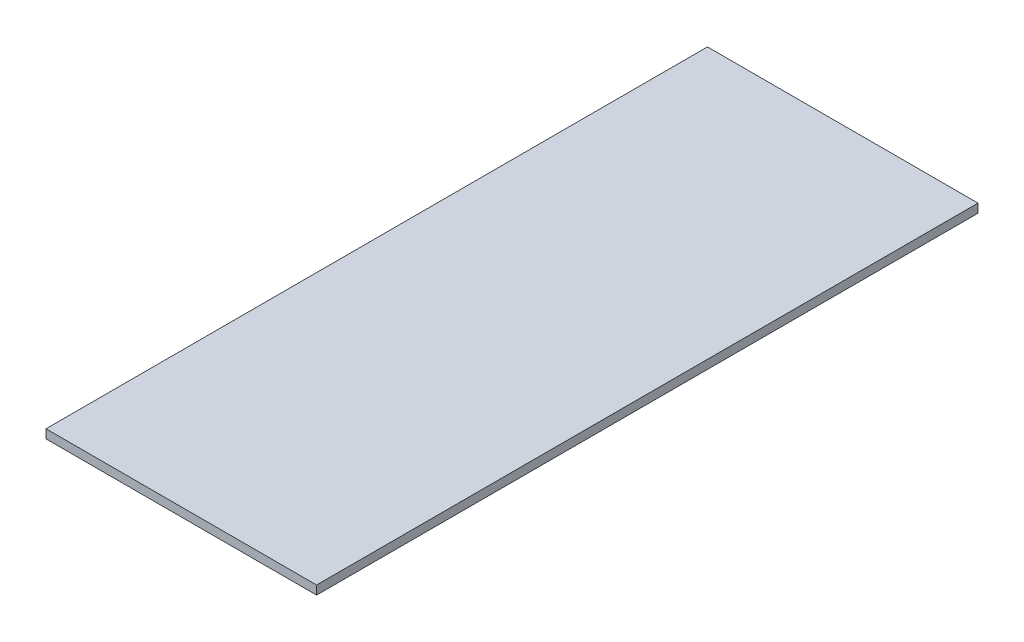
ISO-10303-21;
HEADER;
FILE_DESCRIPTION(('STEP AP214'),'2;1');
FILE_NAME('part.step','',(''),(''),'','','');
FILE_SCHEMA(('AUTOMOTIVE_DESIGN { 1 0 10303 214 1 1 1 1 }'));
ENDSEC;
DATA;
#1=APPLICATION_CONTEXT('core data for automotive mechanical design processes');
#2=APPLICATION_PROTOCOL_DEFINITION('international standard','automotive_design',2000,#1);
#3=PRODUCT_CONTEXT('',#1,'mechanical');
#4=PRODUCT('Part','Part','',(#3));
#5=PRODUCT_RELATED_PRODUCT_CATEGORY('part','',(#4));
#6=PRODUCT_DEFINITION_FORMATION('','',#4);
#7=PRODUCT_DEFINITION_CONTEXT('part definition',#1,'design');
#8=PRODUCT_DEFINITION('design','',#6,#7);
#9=PRODUCT_DEFINITION_SHAPE('','',#8);
#10=(LENGTH_UNIT() NAMED_UNIT(*) SI_UNIT(.MILLI.,.METRE.));
#11=(NAMED_UNIT(*) PLANE_ANGLE_UNIT() SI_UNIT($,.RADIAN.));
#12=(NAMED_UNIT(*) SI_UNIT($,.STERADIAN.) SOLID_ANGLE_UNIT());
#13=UNCERTAINTY_MEASURE_WITH_UNIT(LENGTH_MEASURE(1.E-05),#10,'distance_accuracy_value','');
#14=(GEOMETRIC_REPRESENTATION_CONTEXT(3) GLOBAL_UNCERTAINTY_ASSIGNED_CONTEXT((#13)) GLOBAL_UNIT_ASSIGNED_CONTEXT((#10,
#11,#12)) REPRESENTATION_CONTEXT('',''));
#15=CARTESIAN_POINT('',(0.,0.,0.));
#16=DIRECTION('',(0.,0.,1.));
#17=DIRECTION('',(1.,0.,0.));
#18=AXIS2_PLACEMENT_3D('',#15,#16,#17);
#19=CARTESIAN_POINT('',(85.725,5.55625,-209.55));
#20=DIRECTION('',(-1.,0.,0.));
#21=DIRECTION('',(0.,0.,1.));
#22=AXIS2_PLACEMENT_3D('',#19,#20,#21);
#23=PLANE('',#22);
#24=DIRECTION('',(0.,0.,-1.));
#25=VECTOR('',#24,1.);
#26=CARTESIAN_POINT('',(85.725,0.,-209.55));
#27=LINE('',#26,#25);
#28=CARTESIAN_POINT('',(85.725,0.,209.55));
#29=VERTEX_POINT('',#28);
#30=CARTESIAN_POINT('',(85.725,0.,-209.55));
#31=VERTEX_POINT('',#30);
#32=EDGE_CURVE('E105',#29,#31,#27,.T.);
#33=ORIENTED_EDGE('',*,*,#32,.T.);
#34=DIRECTION('',(0.,-1.,0.));
#35=VECTOR('',#34,1.);
#36=CARTESIAN_POINT('',(85.725,5.55625,-209.55));
#37=LINE('',#36,#35);
#38=CARTESIAN_POINT('',(85.725,5.55625,-209.55));
#39=VERTEX_POINT('',#38);
#40=EDGE_CURVE('E11',#39,#31,#37,.T.);
#41=ORIENTED_EDGE('',*,*,#40,.F.);
#42=DIRECTION('',(0.,0.,-1.));
#43=VECTOR('',#42,1.);
#44=CARTESIAN_POINT('',(85.725,5.55625,-209.55));
#45=LINE('',#44,#43);
#46=CARTESIAN_POINT('',(85.725,5.55625,209.55));
#47=VERTEX_POINT('',#46);
#48=EDGE_CURVE('E88',#47,#39,#45,.T.);
#49=ORIENTED_EDGE('',*,*,#48,.F.);
#50=DIRECTION('',(0.,-1.,0.));
#51=VECTOR('',#50,1.);
#52=CARTESIAN_POINT('',(85.725,5.55625,209.55));
#53=LINE('',#52,#51);
#54=EDGE_CURVE('E101',#47,#29,#53,.T.);
#55=ORIENTED_EDGE('',*,*,#54,.T.);
#56=EDGE_LOOP('',(#33,#41,#49,#55));
#57=FACE_BOUND('',#56,.T.);
#58=ADVANCED_FACE('F36',(#57),#23,.F.);
#59=CARTESIAN_POINT('',(-85.725,5.55625,-209.55));
#60=DIRECTION('',(0.,0.,1.));
#61=DIRECTION('',(1.,0.,0.));
#62=AXIS2_PLACEMENT_3D('',#59,#60,#61);
#63=PLANE('',#62);
#64=DIRECTION('',(-1.,0.,0.));
#65=VECTOR('',#64,1.);
#66=CARTESIAN_POINT('',(-85.725,0.,-209.55));
#67=LINE('',#66,#65);
#68=CARTESIAN_POINT('',(-85.725,0.,-209.55));
#69=VERTEX_POINT('',#68);
#70=EDGE_CURVE('E93',#31,#69,#67,.T.);
#71=ORIENTED_EDGE('',*,*,#70,.T.);
#72=DIRECTION('',(0.,-1.,0.));
#73=VECTOR('',#72,1.);
#74=CARTESIAN_POINT('',(-85.725,5.55625,-209.55));
#75=LINE('',#74,#73);
#76=CARTESIAN_POINT('',(-85.725,5.55625,-209.55));
#77=VERTEX_POINT('',#76);
#78=EDGE_CURVE('E45',#77,#69,#75,.T.);
#79=ORIENTED_EDGE('',*,*,#78,.F.);
#80=DIRECTION('',(-1.,0.,0.));
#81=VECTOR('',#80,1.);
#82=CARTESIAN_POINT('',(-85.725,5.55625,-209.55));
#83=LINE('',#82,#81);
#84=EDGE_CURVE('E83',#39,#77,#83,.T.);
#85=ORIENTED_EDGE('',*,*,#84,.F.);
#86=ORIENTED_EDGE('',*,*,#40,.T.);
#87=EDGE_LOOP('',(#71,#79,#85,#86));
#88=FACE_BOUND('',#87,.T.);
#89=ADVANCED_FACE('F92',(#88),#63,.F.);
#90=CARTESIAN_POINT('',(-85.725,5.55625,-209.55));
#91=DIRECTION('',(1.,0.,0.));
#92=DIRECTION('',(0.,0.,-1.));
#93=AXIS2_PLACEMENT_3D('',#90,#91,#92);
#94=PLANE('',#93);
#95=DIRECTION('',(0.,0.,1.));
#96=VECTOR('',#95,1.);
#97=CARTESIAN_POINT('',(-85.725,0.,-209.55));
#98=LINE('',#97,#96);
#99=CARTESIAN_POINT('',(-85.725,0.,209.55));
#100=VERTEX_POINT('',#99);
#101=EDGE_CURVE('E70',#69,#100,#98,.T.);
#102=ORIENTED_EDGE('',*,*,#101,.T.);
#103=DIRECTION('',(0.,-1.,0.));
#104=VECTOR('',#103,1.);
#105=CARTESIAN_POINT('',(-85.725,5.55625,209.55));
#106=LINE('',#105,#104);
#107=CARTESIAN_POINT('',(-85.725,5.55625,209.55));
#108=VERTEX_POINT('',#107);
#109=EDGE_CURVE('E95',#108,#100,#106,.T.);
#110=ORIENTED_EDGE('',*,*,#109,.F.);
#111=DIRECTION('',(0.,0.,1.));
#112=VECTOR('',#111,1.);
#113=CARTESIAN_POINT('',(-85.725,5.55625,-209.55));
#114=LINE('',#113,#112);
#115=EDGE_CURVE('E86',#77,#108,#114,.T.);
#116=ORIENTED_EDGE('',*,*,#115,.F.);
#117=ORIENTED_EDGE('',*,*,#78,.T.);
#118=EDGE_LOOP('',(#102,#110,#116,#117));
#119=FACE_BOUND('',#118,.T.);
#120=ADVANCED_FACE('F96',(#119),#94,.F.);
#121=CARTESIAN_POINT('',(-85.725,5.55625,209.55));
#122=DIRECTION('',(0.,0.,-1.));
#123=DIRECTION('',(-1.,0.,0.));
#124=AXIS2_PLACEMENT_3D('',#121,#122,#123);
#125=PLANE('',#124);
#126=DIRECTION('',(1.,0.,0.));
#127=VECTOR('',#126,1.);
#128=CARTESIAN_POINT('',(-85.725,0.,209.55));
#129=LINE('',#128,#127);
#130=EDGE_CURVE('E76',#100,#29,#129,.T.);
#131=ORIENTED_EDGE('',*,*,#130,.T.);
#132=ORIENTED_EDGE('',*,*,#54,.F.);
#133=DIRECTION('',(1.,0.,0.));
#134=VECTOR('',#133,1.);
#135=CARTESIAN_POINT('',(-85.725,5.55625,209.55));
#136=LINE('',#135,#134);
#137=EDGE_CURVE('E53',#108,#47,#136,.T.);
#138=ORIENTED_EDGE('',*,*,#137,.F.);
#139=ORIENTED_EDGE('',*,*,#109,.T.);
#140=EDGE_LOOP('',(#131,#132,#138,#139));
#141=FACE_BOUND('',#140,.T.);
#142=ADVANCED_FACE('F119',(#141),#125,.F.);
#143=CARTESIAN_POINT('',(0.,5.55625,0.));
#144=DIRECTION('',(0.,1.,0.));
#145=DIRECTION('',(0.,0.,1.));
#146=AXIS2_PLACEMENT_3D('',#143,#144,#145);
#147=PLANE('',#146);
#148=ORIENTED_EDGE('',*,*,#48,.T.);
#149=ORIENTED_EDGE('',*,*,#84,.T.);
#150=ORIENTED_EDGE('',*,*,#115,.T.);
#151=ORIENTED_EDGE('',*,*,#137,.T.);
#152=EDGE_LOOP('',(#148,#149,#150,#151));
#153=FACE_BOUND('',#152,.T.);
#154=ADVANCED_FACE('F84',(#153),#147,.T.);
#155=CARTESIAN_POINT('',(0.,0.,0.));
#156=DIRECTION('',(0.,1.,0.));
#157=DIRECTION('',(0.,0.,1.));
#158=AXIS2_PLACEMENT_3D('',#155,#156,#157);
#159=PLANE('',#158);
#160=ORIENTED_EDGE('',*,*,#32,.F.);
#161=ORIENTED_EDGE('',*,*,#130,.F.);
#162=ORIENTED_EDGE('',*,*,#101,.F.);
#163=ORIENTED_EDGE('',*,*,#70,.F.);
#164=EDGE_LOOP('',(#160,#161,#162,#163));
#165=FACE_BOUND('',#164,.T.);
#166=ADVANCED_FACE('F122',(#165),#159,.F.);
#167=CLOSED_SHELL('',(#58,#89,#120,#142,#154,#166));
#168=MANIFOLD_SOLID_BREP('B2',#167);
#169=ADVANCED_BREP_SHAPE_REPRESENTATION('',(#18,#168),#14);
#170=SHAPE_DEFINITION_REPRESENTATION(#9,#169);
ENDSEC;
END-ISO-10303-21;
